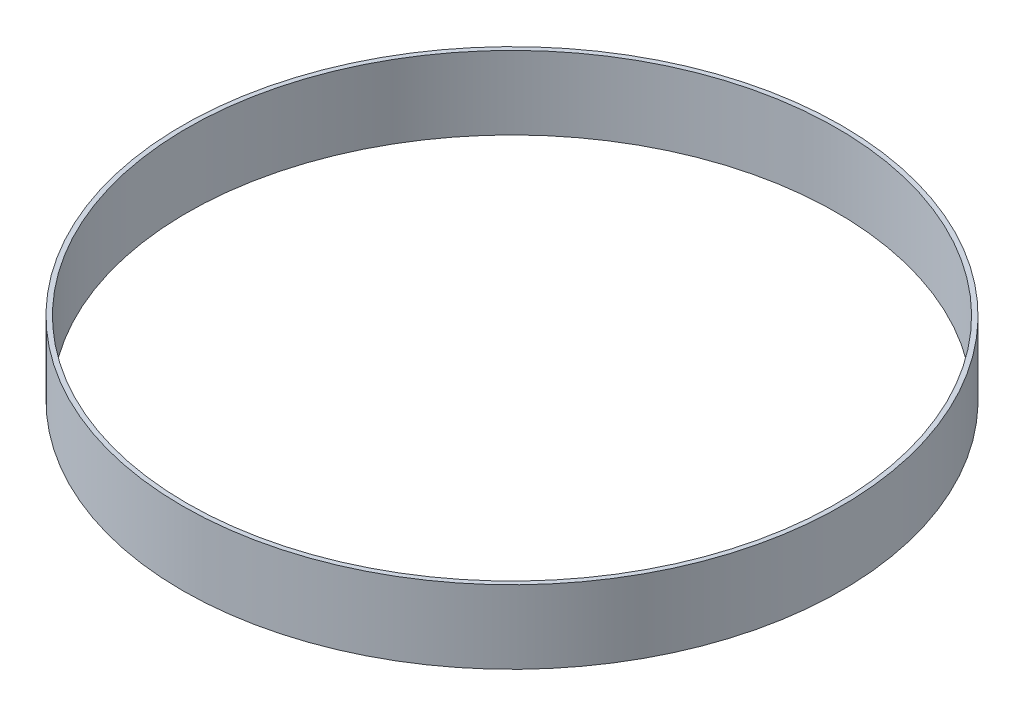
ISO-10303-21;
HEADER;
FILE_DESCRIPTION(('STEP AP214'),'2;1');
FILE_NAME('part.step','',(''),(''),'','','');
FILE_SCHEMA(('AUTOMOTIVE_DESIGN { 1 0 10303 214 1 1 1 1 }'));
ENDSEC;
DATA;
#1=APPLICATION_CONTEXT('core data for automotive mechanical design processes');
#2=APPLICATION_PROTOCOL_DEFINITION('international standard','automotive_design',2000,#1);
#3=PRODUCT_CONTEXT('',#1,'mechanical');
#4=PRODUCT('Part','Part','',(#3));
#5=PRODUCT_RELATED_PRODUCT_CATEGORY('part','',(#4));
#6=PRODUCT_DEFINITION_FORMATION('','',#4);
#7=PRODUCT_DEFINITION_CONTEXT('part definition',#1,'design');
#8=PRODUCT_DEFINITION('design','',#6,#7);
#9=PRODUCT_DEFINITION_SHAPE('','',#8);
#10=(LENGTH_UNIT() NAMED_UNIT(*) SI_UNIT(.MILLI.,.METRE.));
#11=(NAMED_UNIT(*) PLANE_ANGLE_UNIT() SI_UNIT($,.RADIAN.));
#12=(NAMED_UNIT(*) SI_UNIT($,.STERADIAN.) SOLID_ANGLE_UNIT());
#13=UNCERTAINTY_MEASURE_WITH_UNIT(LENGTH_MEASURE(1.E-05),#10,'distance_accuracy_value','');
#14=(GEOMETRIC_REPRESENTATION_CONTEXT(3) GLOBAL_UNCERTAINTY_ASSIGNED_CONTEXT((#13)) GLOBAL_UNIT_ASSIGNED_CONTEXT((#10,
#11,#12)) REPRESENTATION_CONTEXT('',''));
#15=CARTESIAN_POINT('',(0.,0.,0.));
#16=DIRECTION('',(0.,0.,1.));
#17=DIRECTION('',(1.,0.,0.));
#18=AXIS2_PLACEMENT_3D('',#15,#16,#17);
#19=CARTESIAN_POINT('',(-1.79326191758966,101.6,0.));
#20=DIRECTION('',(0.,1.,0.));
#21=DIRECTION('',(0.,0.,1.));
#22=AXIS2_PLACEMENT_3D('',#19,#20,#21);
#23=PLANE('',#22);
#24=CARTESIAN_POINT('',(-1.79326191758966,101.6,0.));
#25=DIRECTION('',(0.,1.,0.));
#26=DIRECTION('',(0.,0.,1.));
#27=AXIS2_PLACEMENT_3D('',#24,#25,#26);
#28=CIRCLE('',#27,457.2);
#29=CARTESIAN_POINT('',(-1.79326191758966,101.6,457.2));
#30=VERTEX_POINT('',#29);
#31=EDGE_CURVE('E10',#30,#30,#28,.T.);
#32=ORIENTED_EDGE('',*,*,#31,.T.);
#33=EDGE_LOOP('',(#32));
#34=FACE_BOUND('',#33,.T.);
#35=CARTESIAN_POINT('',(-1.79326191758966,101.6,0.));
#36=DIRECTION('',(0.,1.,0.));
#37=DIRECTION('',(0.,0.,1.));
#38=AXIS2_PLACEMENT_3D('',#35,#36,#37);
#39=CIRCLE('',#38,450.85);
#40=CARTESIAN_POINT('',(-1.79326191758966,101.6,450.85));
#41=VERTEX_POINT('',#40);
#42=EDGE_CURVE('E43',#41,#41,#39,.T.);
#43=ORIENTED_EDGE('',*,*,#42,.F.);
#44=EDGE_LOOP('',(#43));
#45=FACE_BOUND('',#44,.T.);
#46=ADVANCED_FACE('F32',(#34,#45),#23,.T.);
#47=CARTESIAN_POINT('',(-1.79326191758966,0.,0.));
#48=DIRECTION('',(0.,1.,0.));
#49=DIRECTION('',(0.,0.,1.));
#50=AXIS2_PLACEMENT_3D('',#47,#48,#49);
#51=PLANE('',#50);
#52=CARTESIAN_POINT('',(-1.79326191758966,0.,0.));
#53=DIRECTION('',(0.,1.,0.));
#54=DIRECTION('',(0.,0.,1.));
#55=AXIS2_PLACEMENT_3D('',#52,#53,#54);
#56=CIRCLE('',#55,457.2);
#57=CARTESIAN_POINT('',(-1.79326191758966,0.,457.2));
#58=VERTEX_POINT('',#57);
#59=EDGE_CURVE('E36',#58,#58,#56,.T.);
#60=ORIENTED_EDGE('',*,*,#59,.F.);
#61=EDGE_LOOP('',(#60));
#62=FACE_BOUND('',#61,.T.);
#63=CARTESIAN_POINT('',(-1.79326191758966,0.,0.));
#64=DIRECTION('',(0.,1.,0.));
#65=DIRECTION('',(0.,0.,1.));
#66=AXIS2_PLACEMENT_3D('',#63,#64,#65);
#67=CIRCLE('',#66,450.85);
#68=CARTESIAN_POINT('',(-1.79326191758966,0.,450.85));
#69=VERTEX_POINT('',#68);
#70=EDGE_CURVE('E45',#69,#69,#67,.T.);
#71=ORIENTED_EDGE('',*,*,#70,.T.);
#72=EDGE_LOOP('',(#71));
#73=FACE_BOUND('',#72,.T.);
#74=ADVANCED_FACE('F55',(#62,#73),#51,.F.);
#75=CARTESIAN_POINT('',(-1.79326191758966,101.6,0.));
#76=DIRECTION('',(0.,-1.,0.));
#77=DIRECTION('',(0.,0.,-1.));
#78=AXIS2_PLACEMENT_3D('',#75,#76,#77);
#79=CYLINDRICAL_SURFACE('',#78,457.2);
#80=ORIENTED_EDGE('',*,*,#31,.F.);
#81=EDGE_LOOP('',(#80));
#82=FACE_BOUND('',#81,.T.);
#83=ORIENTED_EDGE('',*,*,#59,.T.);
#84=EDGE_LOOP('',(#83));
#85=FACE_BOUND('',#84,.T.);
#86=ADVANCED_FACE('F34',(#82,#85),#79,.T.);
#87=CARTESIAN_POINT('',(-1.79326191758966,101.6,0.));
#88=DIRECTION('',(0.,-1.,0.));
#89=DIRECTION('',(0.,0.,-1.));
#90=AXIS2_PLACEMENT_3D('',#87,#88,#89);
#91=CYLINDRICAL_SURFACE('',#90,450.85);
#92=ORIENTED_EDGE('',*,*,#42,.T.);
#93=EDGE_LOOP('',(#92));
#94=FACE_BOUND('',#93,.T.);
#95=ORIENTED_EDGE('',*,*,#70,.F.);
#96=EDGE_LOOP('',(#95));
#97=FACE_BOUND('',#96,.T.);
#98=ADVANCED_FACE('F51',(#94,#97),#91,.F.);
#99=CLOSED_SHELL('',(#46,#74,#86,#98));
#100=MANIFOLD_SOLID_BREP('B2',#99);
#101=ADVANCED_BREP_SHAPE_REPRESENTATION('',(#18,#100),#14);
#102=SHAPE_DEFINITION_REPRESENTATION(#9,#101);
ENDSEC;
END-ISO-10303-21;
